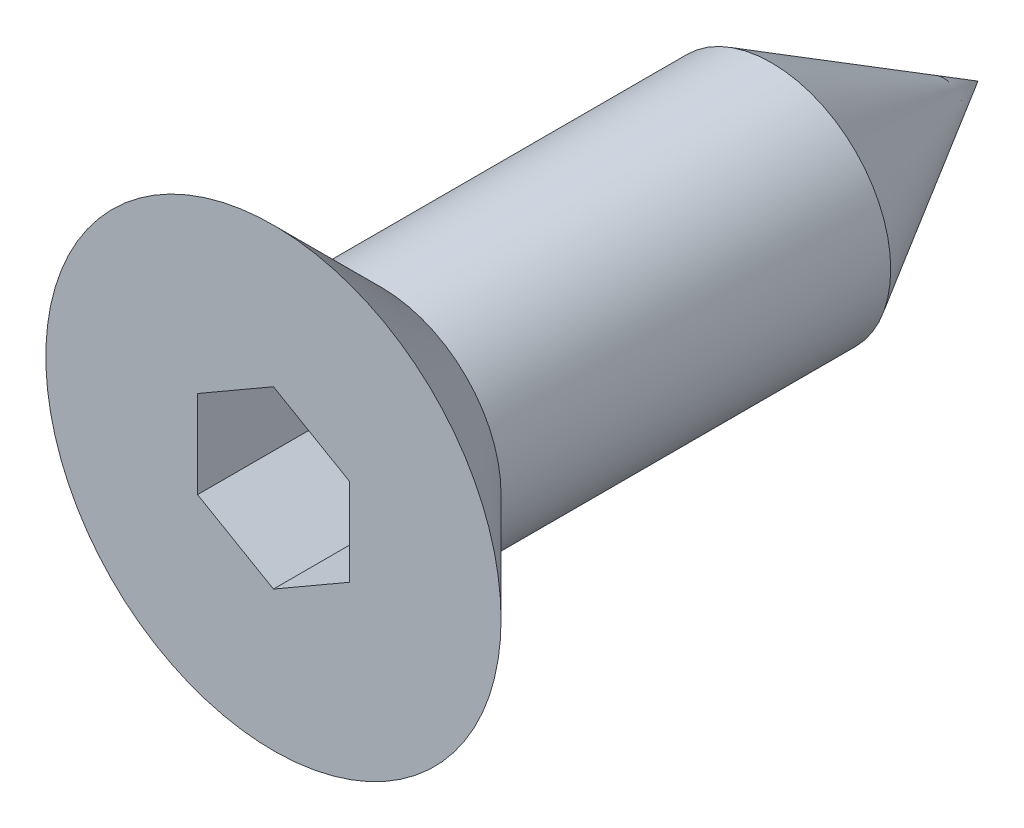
from build123d import *

# Parameters (mm, degrees)
ESQUISSE3_R             = 1.1
EXTRUSION1_DEPTH        = 6.5
ENL_V_MAT_EXTRU_2_DEPTH = 1.5
CHANFREIN1_SIZE         = 1.1
CHANFREIN1_SIZE2        = 1.905255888


with BuildPart() as part:
    # Esquisse1 → R_volution2 (revolve)
    with BuildSketch(Plane(origin=(0, 0, 0), x_dir=(0, 0, -1), z_dir=(1, 0, 0)), mode=Mode.PRIVATE) as r_volution2_sk:
        Polygon((0, 2.1), (1, 1.1), (1, 0), (0, 0), align=None)
    revolve(r_volution2_sk.sketch.rotate(Axis((0, 0, 1.603508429), (0, 0, -1)), 90), axis=Axis((0, 0, 1.603508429), (0, 0, -1)))

    # Esquisse3 → Extrusion1 (add)
    with BuildSketch(Plane.XY):
        Circle(ESQUISSE3_R)
    extrude(amount=-EXTRUSION1_DEPTH)

    # Esquisse2 → Enl_v. mat.-Extru.2 (cut)
    with BuildSketch(Plane.XY):
        Polygon((0, 0.808290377), (-0.7, 0.404145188), (-0.7, -0.404145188), (0, -0.808290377), (0.7, -0.404145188), (0.7, 0.404145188), align=None)
    extrude(amount=-ENL_V_MAT_EXTRU_2_DEPTH, mode=Mode.SUBTRACT)

    # Chanfrein1
    chanfrein1_edges = [part.edges().sort_by_distance(p)[0] for p in [
        (-1.1, 0, -6.5),
    ]]
    chanfrein1_side = [part.faces().sort_by_distance(p)[0] for p in [
        (0, 0, -6.5),
    ]]
    chamfer(chanfrein1_edges, length=CHANFREIN1_SIZE, length2=CHANFREIN1_SIZE2, reference=chanfrein1_side[0])


solid = part.part
